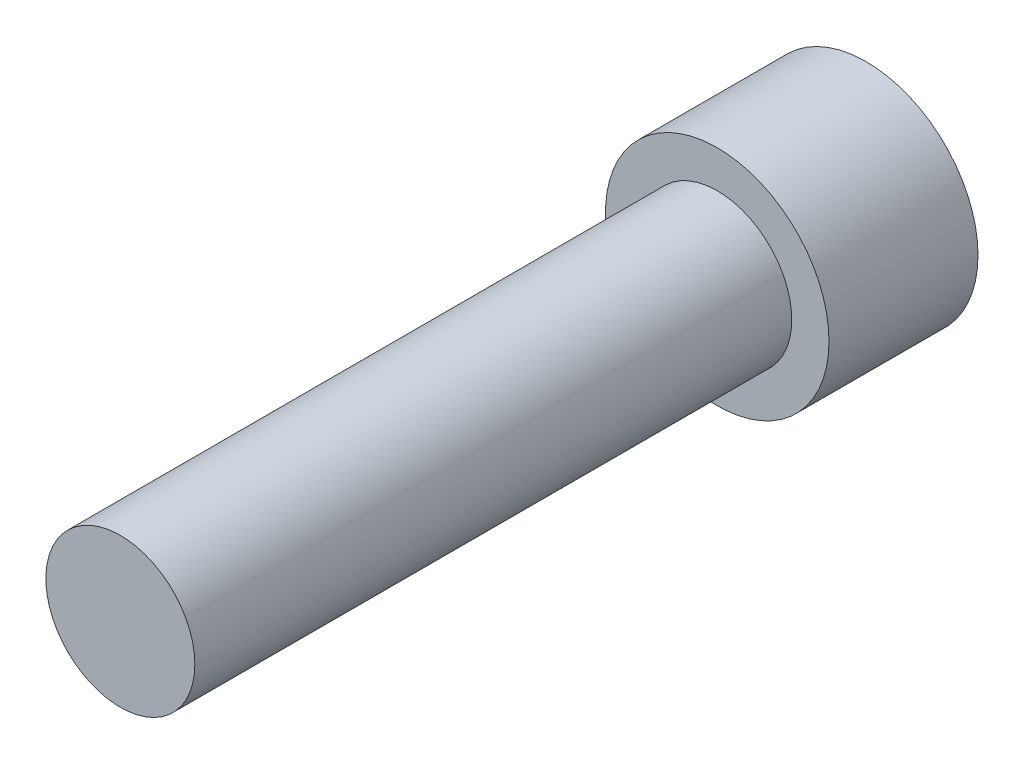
from build123d import *

# Parameters (mm, degrees)
HEX_2_DEPTH = 4.826


with BuildPart() as part:
    # Sketch6 → Revolve1 (revolve)
    with BuildSketch(Plane(origin=(0, 0, 0), x_dir=(0, 0, -1), z_dir=(1, 0, 0)), mode=Mode.PRIVATE) as revolve1_sk:
        Polygon((-31.75, 0), (-31.75, -3.9624), (0, -3.9624), (0, -5.9436), (7.9248, -5.9436), (7.9248, 0), align=None)
    revolve(revolve1_sk.sketch.rotate(Axis((0, 0, 31.75), (0, 0, -1)), 270), axis=Axis((0, 0, 31.75), (0, 0, -1)))

    # Sketch7 → HEX 2 (cut)
    with BuildSketch(Plane(origin=(0, 0, -7.9248), x_dir=(-1, 0, 0), z_dir=(0, 0, -1))):
        Polygon((-3.175, 1.833087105), (-3.175, -1.833087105), (0, -3.666174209), (3.175, -1.833087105), (3.175, 1.833087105), (0, 3.666174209), align=None)
    extrude(amount=-HEX_2_DEPTH, mode=Mode.SUBTRACT)


solid = part.part
